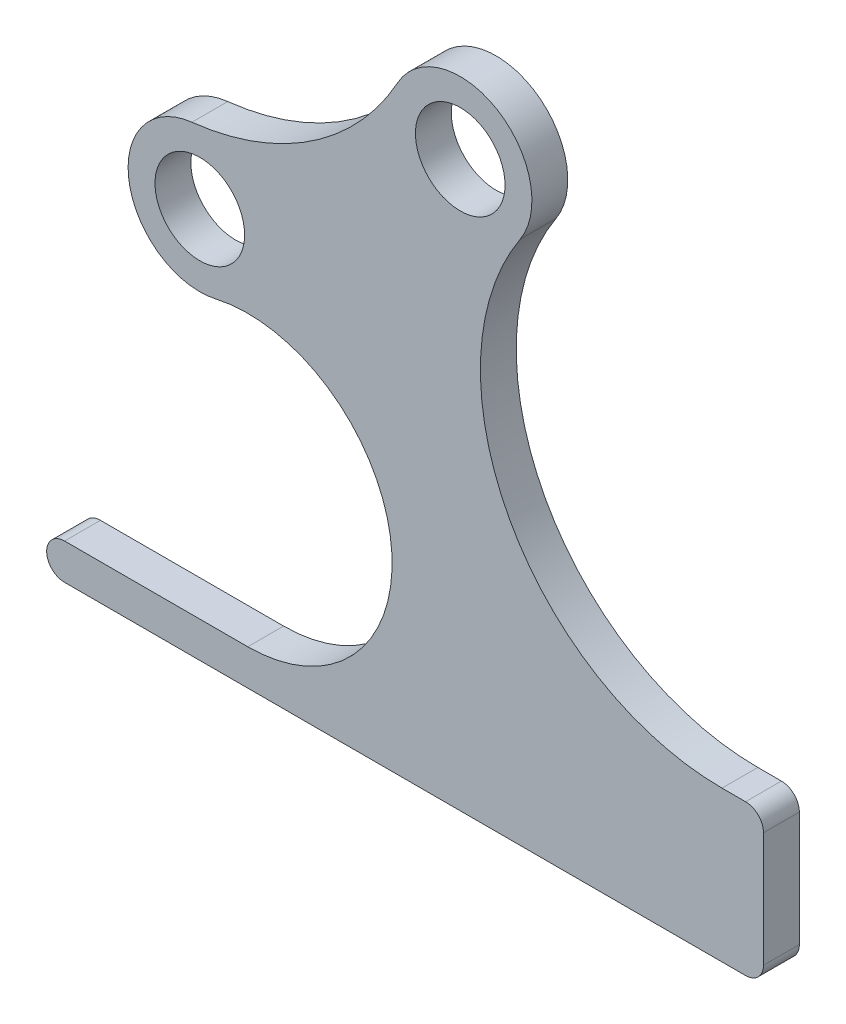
ISO-10303-21;
HEADER;
FILE_DESCRIPTION(('STEP AP214'),'2;1');
FILE_NAME('part.step','',(''),(''),'','','');
FILE_SCHEMA(('AUTOMOTIVE_DESIGN { 1 0 10303 214 1 1 1 1 }'));
ENDSEC;
DATA;
#1=APPLICATION_CONTEXT('core data for automotive mechanical design processes');
#2=APPLICATION_PROTOCOL_DEFINITION('international standard','automotive_design',2000,#1);
#3=PRODUCT_CONTEXT('',#1,'mechanical');
#4=PRODUCT('Part','Part','',(#3));
#5=PRODUCT_RELATED_PRODUCT_CATEGORY('part','',(#4));
#6=PRODUCT_DEFINITION_FORMATION('','',#4);
#7=PRODUCT_DEFINITION_CONTEXT('part definition',#1,'design');
#8=PRODUCT_DEFINITION('design','',#6,#7);
#9=PRODUCT_DEFINITION_SHAPE('','',#8);
#10=(LENGTH_UNIT() NAMED_UNIT(*) SI_UNIT(.MILLI.,.METRE.));
#11=(NAMED_UNIT(*) PLANE_ANGLE_UNIT() SI_UNIT($,.RADIAN.));
#12=(NAMED_UNIT(*) SI_UNIT($,.STERADIAN.) SOLID_ANGLE_UNIT());
#13=UNCERTAINTY_MEASURE_WITH_UNIT(LENGTH_MEASURE(1.E-05),#10,'distance_accuracy_value','');
#14=(GEOMETRIC_REPRESENTATION_CONTEXT(3) GLOBAL_UNCERTAINTY_ASSIGNED_CONTEXT((#13)) GLOBAL_UNIT_ASSIGNED_CONTEXT((#10,
#11,#12)) REPRESENTATION_CONTEXT('',''));
#15=CARTESIAN_POINT('',(0.,0.,0.));
#16=DIRECTION('',(0.,0.,1.));
#17=DIRECTION('',(1.,0.,0.));
#18=AXIS2_PLACEMENT_3D('',#15,#16,#17);
#19=CARTESIAN_POINT('',(-126.091296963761,4.99999999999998,10.));
#20=DIRECTION('',(0.,0.,-1.));
#21=DIRECTION('',(-1.,0.,0.));
#22=AXIS2_PLACEMENT_3D('',#19,#20,#21);
#23=PLANE('',#22);
#24=CARTESIAN_POINT('',(-15.7032811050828,157.437923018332,10.));
#25=DIRECTION('',(0.,0.,1.));
#26=DIRECTION('',(1.,0.,0.));
#27=AXIS2_PLACEMENT_3D('',#24,#25,#26);
#28=CIRCLE('',#27,12.5);
#29=CARTESIAN_POINT('',(-3.20328110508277,157.437923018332,10.));
#30=VERTEX_POINT('',#29);
#31=EDGE_CURVE('E161',#30,#30,#28,.T.);
#32=ORIENTED_EDGE('',*,*,#31,.F.);
#33=EDGE_LOOP('',(#32));
#34=FACE_BOUND('',#33,.T.);
#35=DIRECTION('',(1.,0.,0.));
#36=VECTOR('',#35,1.);
#37=CARTESIAN_POINT('',(63.9087030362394,0.,10.));
#38=LINE('',#37,#36);
#39=CARTESIAN_POINT('',(-126.091296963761,0.,10.));
#40=VERTEX_POINT('',#39);
#41=CARTESIAN_POINT('',(63.9087030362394,0.,10.));
#42=VERTEX_POINT('',#41);
#43=EDGE_CURVE('E50',#40,#42,#38,.T.);
#44=ORIENTED_EDGE('',*,*,#43,.T.);
#45=CARTESIAN_POINT('',(63.9087030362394,5.,10.));
#46=DIRECTION('',(0.,0.,1.));
#47=DIRECTION('',(-1.,0.,0.));
#48=AXIS2_PLACEMENT_3D('',#45,#46,#47);
#49=CIRCLE('',#48,5.);
#50=CARTESIAN_POINT('',(68.9087030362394,5.,10.));
#51=VERTEX_POINT('',#50);
#52=EDGE_CURVE('E106',#42,#51,#49,.T.);
#53=ORIENTED_EDGE('',*,*,#52,.T.);
#54=DIRECTION('',(0.,1.,0.));
#55=VECTOR('',#54,1.);
#56=CARTESIAN_POINT('',(68.9087030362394,37.,10.));
#57=LINE('',#56,#55);
#58=CARTESIAN_POINT('',(68.9087030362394,37.,10.));
#59=VERTEX_POINT('',#58);
#60=EDGE_CURVE('E206',#51,#59,#57,.T.);
#61=ORIENTED_EDGE('',*,*,#60,.T.);
#62=CARTESIAN_POINT('',(63.9087030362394,37.,10.));
#63=DIRECTION('',(0.,0.,1.));
#64=DIRECTION('',(-1.,0.,0.));
#65=AXIS2_PLACEMENT_3D('',#62,#63,#64);
#66=CIRCLE('',#65,5.00000000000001);
#67=CARTESIAN_POINT('',(63.9087030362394,42.,10.));
#68=VERTEX_POINT('',#67);
#69=EDGE_CURVE('E226',#59,#68,#66,.T.);
#70=ORIENTED_EDGE('',*,*,#69,.T.);
#71=DIRECTION('',(-1.,0.,0.));
#72=VECTOR('',#71,1.);
#73=CARTESIAN_POINT('',(57.3337492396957,42.,10.));
#74=LINE('',#73,#72);
#75=CARTESIAN_POINT('',(57.3337492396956,42.,10.));
#76=VERTEX_POINT('',#75);
#77=EDGE_CURVE('E223',#68,#76,#74,.T.);
#78=ORIENTED_EDGE('',*,*,#77,.T.);
#79=CARTESIAN_POINT('',(57.3337492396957,109.412145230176,10.));
#80=DIRECTION('',(0.,0.,-1.));
#81=DIRECTION('',(1.,0.,0.));
#82=AXIS2_PLACEMENT_3D('',#79,#80,#81);
#83=CIRCLE('',#82,67.4121452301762);
#84=CARTESIAN_POINT('',(1.00767597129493,146.449569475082,10.));
#85=VERTEX_POINT('',#84);
#86=EDGE_CURVE('E225',#76,#85,#83,.T.);
#87=ORIENTED_EDGE('',*,*,#86,.T.);
#88=CARTESIAN_POINT('',(-15.7032811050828,157.437923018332,10.));
#89=DIRECTION('',(0.,0.,1.));
#90=DIRECTION('',(-1.,0.,0.));
#91=AXIS2_PLACEMENT_3D('',#88,#89,#90);
#92=CIRCLE('',#91,20.);
#93=CARTESIAN_POINT('',(-33.1959274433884,167.133660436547,10.));
#94=VERTEX_POINT('',#93);
#95=EDGE_CURVE('E228',#85,#94,#92,.T.);
#96=ORIENTED_EDGE('',*,*,#95,.T.);
#97=CARTESIAN_POINT('',(-98.7933512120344,203.492675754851,10.));
#98=DIRECTION('',(0.,0.,-1.));
#99=DIRECTION('',(1.,0.,0.));
#100=AXIS2_PLACEMENT_3D('',#97,#98,#99);
#101=CIRCLE('',#100,75.);
#102=CARTESIAN_POINT('',(-90.5604805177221,128.945912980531,10.));
#103=VERTEX_POINT('',#102);
#104=EDGE_CURVE('E234',#94,#103,#101,.T.);
#105=ORIENTED_EDGE('',*,*,#104,.T.);
#106=CARTESIAN_POINT('',(-88.3650483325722,109.066776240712,10.));
#107=DIRECTION('',(0.,0.,1.));
#108=DIRECTION('',(-1.,0.,0.));
#109=AXIS2_PLACEMENT_3D('',#106,#107,#108);
#110=CIRCLE('',#109,20.);
#111=CARTESIAN_POINT('',(-83.9273688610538,89.5653147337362,10.));
#112=VERTEX_POINT('',#111);
#113=EDGE_CURVE('E138',#103,#112,#110,.T.);
#114=ORIENTED_EDGE('',*,*,#113,.T.);
#115=CARTESIAN_POINT('',(-74.9888296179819,50.28474476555,10.));
#116=DIRECTION('',(0.,0.,-1.));
#117=DIRECTION('',(1.,0.,0.));
#118=AXIS2_PLACEMENT_3D('',#115,#116,#117);
#119=CIRCLE('',#118,40.28474476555);
#120=CARTESIAN_POINT('',(-74.9888296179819,9.99999999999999,10.));
#121=VERTEX_POINT('',#120);
#122=EDGE_CURVE('E132',#112,#121,#119,.T.);
#123=ORIENTED_EDGE('',*,*,#122,.T.);
#124=DIRECTION('',(-1.,0.,0.));
#125=VECTOR('',#124,1.);
#126=CARTESIAN_POINT('',(-126.091296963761,9.99999999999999,10.));
#127=LINE('',#126,#125);
#128=CARTESIAN_POINT('',(-126.091296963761,9.99999999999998,10.));
#129=VERTEX_POINT('',#128);
#130=EDGE_CURVE('E136',#121,#129,#127,.T.);
#131=ORIENTED_EDGE('',*,*,#130,.T.);
#132=CARTESIAN_POINT('',(-126.091296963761,4.99999999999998,10.));
#133=DIRECTION('',(0.,0.,1.));
#134=DIRECTION('',(-1.,0.,0.));
#135=AXIS2_PLACEMENT_3D('',#132,#133,#134);
#136=CIRCLE('',#135,5.);
#137=EDGE_CURVE('E152',#129,#40,#136,.T.);
#138=ORIENTED_EDGE('',*,*,#137,.T.);
#139=EDGE_LOOP('',(#44,#53,#61,#70,#78,#87,#96,#105,#114,#123,#131,#138));
#140=FACE_BOUND('',#139,.T.);
#141=CARTESIAN_POINT('',(-88.3650483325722,109.066776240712,10.));
#142=DIRECTION('',(0.,0.,1.));
#143=DIRECTION('',(1.,0.,0.));
#144=AXIS2_PLACEMENT_3D('',#141,#142,#143);
#145=CIRCLE('',#144,12.5);
#146=CARTESIAN_POINT('',(-75.8650483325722,109.066776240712,10.));
#147=VERTEX_POINT('',#146);
#148=EDGE_CURVE('E253',#147,#147,#145,.T.);
#149=ORIENTED_EDGE('',*,*,#148,.F.);
#150=EDGE_LOOP('',(#149));
#151=FACE_BOUND('',#150,.T.);
#152=ADVANCED_FACE('F33',(#34,#140,#151),#23,.F.);
#153=CARTESIAN_POINT('',(-126.091296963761,4.99999999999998,0.));
#154=DIRECTION('',(0.,0.,-1.));
#155=DIRECTION('',(-1.,0.,0.));
#156=AXIS2_PLACEMENT_3D('',#153,#154,#155);
#157=PLANE('',#156);
#158=CARTESIAN_POINT('',(-15.7032811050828,157.437923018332,0.));
#159=DIRECTION('',(0.,0.,1.));
#160=DIRECTION('',(1.,0.,0.));
#161=AXIS2_PLACEMENT_3D('',#158,#159,#160);
#162=CIRCLE('',#161,12.5);
#163=CARTESIAN_POINT('',(-3.20328110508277,157.437923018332,0.));
#164=VERTEX_POINT('',#163);
#165=EDGE_CURVE('E250',#164,#164,#162,.T.);
#166=ORIENTED_EDGE('',*,*,#165,.T.);
#167=EDGE_LOOP('',(#166));
#168=FACE_BOUND('',#167,.T.);
#169=CARTESIAN_POINT('',(63.9087030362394,5.,0.));
#170=DIRECTION('',(0.,0.,1.));
#171=DIRECTION('',(-1.,0.,0.));
#172=AXIS2_PLACEMENT_3D('',#169,#170,#171);
#173=CIRCLE('',#172,5.);
#174=CARTESIAN_POINT('',(63.9087030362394,0.,0.));
#175=VERTEX_POINT('',#174);
#176=CARTESIAN_POINT('',(68.9087030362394,5.,0.));
#177=VERTEX_POINT('',#176);
#178=EDGE_CURVE('E158',#175,#177,#173,.T.);
#179=ORIENTED_EDGE('',*,*,#178,.F.);
#180=DIRECTION('',(1.,0.,0.));
#181=VECTOR('',#180,1.);
#182=CARTESIAN_POINT('',(0.,0.,0.));
#183=LINE('',#182,#181);
#184=CARTESIAN_POINT('',(-126.091296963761,0.,0.));
#185=VERTEX_POINT('',#184);
#186=EDGE_CURVE('E178',#185,#175,#183,.T.);
#187=ORIENTED_EDGE('',*,*,#186,.F.);
#188=CARTESIAN_POINT('',(-126.091296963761,4.99999999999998,0.));
#189=DIRECTION('',(0.,0.,1.));
#190=DIRECTION('',(-1.,0.,0.));
#191=AXIS2_PLACEMENT_3D('',#188,#189,#190);
#192=CIRCLE('',#191,5.);
#193=CARTESIAN_POINT('',(-126.091296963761,9.99999999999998,0.));
#194=VERTEX_POINT('',#193);
#195=EDGE_CURVE('E99',#194,#185,#192,.T.);
#196=ORIENTED_EDGE('',*,*,#195,.F.);
#197=DIRECTION('',(-1.,0.,0.));
#198=VECTOR('',#197,1.);
#199=CARTESIAN_POINT('',(-126.091296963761,9.99999999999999,0.));
#200=LINE('',#199,#198);
#201=CARTESIAN_POINT('',(-74.9888296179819,9.99999999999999,0.));
#202=VERTEX_POINT('',#201);
#203=EDGE_CURVE('E92',#202,#194,#200,.T.);
#204=ORIENTED_EDGE('',*,*,#203,.F.);
#205=CARTESIAN_POINT('',(-74.9888296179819,50.28474476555,0.));
#206=DIRECTION('',(0.,0.,-1.));
#207=DIRECTION('',(1.,0.,0.));
#208=AXIS2_PLACEMENT_3D('',#205,#206,#207);
#209=CIRCLE('',#208,40.28474476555);
#210=CARTESIAN_POINT('',(-83.9273688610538,89.5653147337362,0.));
#211=VERTEX_POINT('',#210);
#212=EDGE_CURVE('E146',#211,#202,#209,.T.);
#213=ORIENTED_EDGE('',*,*,#212,.F.);
#214=CARTESIAN_POINT('',(-88.3650483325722,109.066776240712,0.));
#215=DIRECTION('',(0.,0.,1.));
#216=DIRECTION('',(-1.,0.,0.));
#217=AXIS2_PLACEMENT_3D('',#214,#215,#216);
#218=CIRCLE('',#217,20.);
#219=CARTESIAN_POINT('',(-90.5604805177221,128.945912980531,0.));
#220=VERTEX_POINT('',#219);
#221=EDGE_CURVE('E173',#220,#211,#218,.T.);
#222=ORIENTED_EDGE('',*,*,#221,.F.);
#223=CARTESIAN_POINT('',(-98.7933512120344,203.492675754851,0.));
#224=DIRECTION('',(0.,0.,-1.));
#225=DIRECTION('',(1.,0.,0.));
#226=AXIS2_PLACEMENT_3D('',#223,#224,#225);
#227=CIRCLE('',#226,75.);
#228=CARTESIAN_POINT('',(-33.1959274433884,167.133660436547,0.));
#229=VERTEX_POINT('',#228);
#230=EDGE_CURVE('E171',#229,#220,#227,.T.);
#231=ORIENTED_EDGE('',*,*,#230,.F.);
#232=CARTESIAN_POINT('',(-15.7032811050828,157.437923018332,0.));
#233=DIRECTION('',(0.,0.,1.));
#234=DIRECTION('',(-1.,0.,0.));
#235=AXIS2_PLACEMENT_3D('',#232,#233,#234);
#236=CIRCLE('',#235,20.);
#237=CARTESIAN_POINT('',(1.00767597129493,146.449569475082,0.));
#238=VERTEX_POINT('',#237);
#239=EDGE_CURVE('E169',#238,#229,#236,.T.);
#240=ORIENTED_EDGE('',*,*,#239,.F.);
#241=CARTESIAN_POINT('',(57.3337492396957,109.412145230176,0.));
#242=DIRECTION('',(0.,0.,-1.));
#243=DIRECTION('',(1.,0.,0.));
#244=AXIS2_PLACEMENT_3D('',#241,#242,#243);
#245=CIRCLE('',#244,67.4121452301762);
#246=CARTESIAN_POINT('',(57.3337492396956,42.,0.));
#247=VERTEX_POINT('',#246);
#248=EDGE_CURVE('E167',#247,#238,#245,.T.);
#249=ORIENTED_EDGE('',*,*,#248,.F.);
#250=DIRECTION('',(-1.,0.,0.));
#251=VECTOR('',#250,1.);
#252=CARTESIAN_POINT('',(57.3337492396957,42.,0.));
#253=LINE('',#252,#251);
#254=CARTESIAN_POINT('',(63.9087030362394,42.,0.));
#255=VERTEX_POINT('',#254);
#256=EDGE_CURVE('E165',#255,#247,#253,.T.);
#257=ORIENTED_EDGE('',*,*,#256,.F.);
#258=CARTESIAN_POINT('',(63.9087030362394,37.,0.));
#259=DIRECTION('',(0.,0.,1.));
#260=DIRECTION('',(-1.,0.,0.));
#261=AXIS2_PLACEMENT_3D('',#258,#259,#260);
#262=CIRCLE('',#261,5.00000000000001);
#263=CARTESIAN_POINT('',(68.9087030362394,37.,0.));
#264=VERTEX_POINT('',#263);
#265=EDGE_CURVE('E163',#264,#255,#262,.T.);
#266=ORIENTED_EDGE('',*,*,#265,.F.);
#267=DIRECTION('',(0.,1.,0.));
#268=VECTOR('',#267,1.);
#269=CARTESIAN_POINT('',(68.9087030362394,37.,0.));
#270=LINE('',#269,#268);
#271=EDGE_CURVE('E160',#177,#264,#270,.T.);
#272=ORIENTED_EDGE('',*,*,#271,.F.);
#273=EDGE_LOOP('',(#179,#187,#196,#204,#213,#222,#231,#240,#249,#257,#266,#272));
#274=FACE_BOUND('',#273,.T.);
#275=CARTESIAN_POINT('',(-88.3650483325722,109.066776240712,0.));
#276=DIRECTION('',(0.,0.,1.));
#277=DIRECTION('',(1.,0.,0.));
#278=AXIS2_PLACEMENT_3D('',#275,#276,#277);
#279=CIRCLE('',#278,12.5);
#280=CARTESIAN_POINT('',(-75.8650483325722,109.066776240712,0.));
#281=VERTEX_POINT('',#280);
#282=EDGE_CURVE('E256',#281,#281,#279,.T.);
#283=ORIENTED_EDGE('',*,*,#282,.T.);
#284=EDGE_LOOP('',(#283));
#285=FACE_BOUND('',#284,.T.);
#286=ADVANCED_FACE('F210',(#168,#274,#285),#157,.T.);
#287=CARTESIAN_POINT('',(63.9087030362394,5.,10.));
#288=DIRECTION('',(0.,0.,-1.));
#289=DIRECTION('',(-1.,0.,0.));
#290=AXIS2_PLACEMENT_3D('',#287,#288,#289);
#291=CYLINDRICAL_SURFACE('',#290,5.);
#292=ORIENTED_EDGE('',*,*,#178,.T.);
#293=DIRECTION('',(0.,0.,-1.));
#294=VECTOR('',#293,1.);
#295=CARTESIAN_POINT('',(68.9087030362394,5.,10.));
#296=LINE('',#295,#294);
#297=EDGE_CURVE('E42',#51,#177,#296,.T.);
#298=ORIENTED_EDGE('',*,*,#297,.F.);
#299=ORIENTED_EDGE('',*,*,#52,.F.);
#300=DIRECTION('',(0.,0.,-1.));
#301=VECTOR('',#300,1.);
#302=CARTESIAN_POINT('',(63.9087030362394,0.,10.));
#303=LINE('',#302,#301);
#304=EDGE_CURVE('E11',#42,#175,#303,.T.);
#305=ORIENTED_EDGE('',*,*,#304,.T.);
#306=EDGE_LOOP('',(#292,#298,#299,#305));
#307=FACE_BOUND('',#306,.T.);
#308=ADVANCED_FACE('F35',(#307),#291,.T.);
#309=CARTESIAN_POINT('',(68.9087030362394,37.,10.));
#310=DIRECTION('',(-1.,0.,0.));
#311=DIRECTION('',(0.,-1.,0.));
#312=AXIS2_PLACEMENT_3D('',#309,#310,#311);
#313=PLANE('',#312);
#314=ORIENTED_EDGE('',*,*,#271,.T.);
#315=DIRECTION('',(0.,0.,-1.));
#316=VECTOR('',#315,1.);
#317=CARTESIAN_POINT('',(68.9087030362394,37.,10.));
#318=LINE('',#317,#316);
#319=EDGE_CURVE('E198',#59,#264,#318,.T.);
#320=ORIENTED_EDGE('',*,*,#319,.F.);
#321=ORIENTED_EDGE('',*,*,#60,.F.);
#322=ORIENTED_EDGE('',*,*,#297,.T.);
#323=EDGE_LOOP('',(#314,#320,#321,#322));
#324=FACE_BOUND('',#323,.T.);
#325=ADVANCED_FACE('F204',(#324),#313,.F.);
#326=CARTESIAN_POINT('',(63.9087030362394,37.,10.));
#327=DIRECTION('',(0.,0.,-1.));
#328=DIRECTION('',(-1.,0.,0.));
#329=AXIS2_PLACEMENT_3D('',#326,#327,#328);
#330=CYLINDRICAL_SURFACE('',#329,5.00000000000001);
#331=ORIENTED_EDGE('',*,*,#265,.T.);
#332=DIRECTION('',(0.,0.,-1.));
#333=VECTOR('',#332,1.);
#334=CARTESIAN_POINT('',(63.9087030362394,42.,10.));
#335=LINE('',#334,#333);
#336=EDGE_CURVE('E195',#68,#255,#335,.T.);
#337=ORIENTED_EDGE('',*,*,#336,.F.);
#338=ORIENTED_EDGE('',*,*,#69,.F.);
#339=ORIENTED_EDGE('',*,*,#319,.T.);
#340=EDGE_LOOP('',(#331,#337,#338,#339));
#341=FACE_BOUND('',#340,.T.);
#342=ADVANCED_FACE('F217',(#341),#330,.T.);
#343=CARTESIAN_POINT('',(57.3337492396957,42.,10.));
#344=DIRECTION('',(0.,-1.,0.));
#345=DIRECTION('',(0.,0.,-1.));
#346=AXIS2_PLACEMENT_3D('',#343,#344,#345);
#347=PLANE('',#346);
#348=ORIENTED_EDGE('',*,*,#256,.T.);
#349=DIRECTION('',(0.,0.,-1.));
#350=VECTOR('',#349,1.);
#351=CARTESIAN_POINT('',(57.3337492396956,42.,10.));
#352=LINE('',#351,#350);
#353=EDGE_CURVE('E192',#76,#247,#352,.T.);
#354=ORIENTED_EDGE('',*,*,#353,.F.);
#355=ORIENTED_EDGE('',*,*,#77,.F.);
#356=ORIENTED_EDGE('',*,*,#336,.T.);
#357=EDGE_LOOP('',(#348,#354,#355,#356));
#358=FACE_BOUND('',#357,.T.);
#359=ADVANCED_FACE('F221',(#358),#347,.F.);
#360=CARTESIAN_POINT('',(57.3337492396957,109.412145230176,10.));
#361=DIRECTION('',(0.,0.,-1.));
#362=DIRECTION('',(-1.,0.,0.));
#363=AXIS2_PLACEMENT_3D('',#360,#361,#362);
#364=CYLINDRICAL_SURFACE('',#363,67.4121452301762);
#365=ORIENTED_EDGE('',*,*,#248,.T.);
#366=DIRECTION('',(0.,0.,-1.));
#367=VECTOR('',#366,1.);
#368=CARTESIAN_POINT('',(1.00767597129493,146.449569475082,10.));
#369=LINE('',#368,#367);
#370=EDGE_CURVE('E189',#85,#238,#369,.T.);
#371=ORIENTED_EDGE('',*,*,#370,.F.);
#372=ORIENTED_EDGE('',*,*,#86,.F.);
#373=ORIENTED_EDGE('',*,*,#353,.T.);
#374=EDGE_LOOP('',(#365,#371,#372,#373));
#375=FACE_BOUND('',#374,.T.);
#376=ADVANCED_FACE('F292',(#375),#364,.F.);
#377=CARTESIAN_POINT('',(-15.7032811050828,157.437923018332,10.));
#378=DIRECTION('',(0.,0.,-1.));
#379=DIRECTION('',(-1.,0.,0.));
#380=AXIS2_PLACEMENT_3D('',#377,#378,#379);
#381=CYLINDRICAL_SURFACE('',#380,20.);
#382=ORIENTED_EDGE('',*,*,#239,.T.);
#383=DIRECTION('',(0.,0.,-1.));
#384=VECTOR('',#383,1.);
#385=CARTESIAN_POINT('',(-33.1959274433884,167.133660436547,10.));
#386=LINE('',#385,#384);
#387=EDGE_CURVE('E186',#94,#229,#386,.T.);
#388=ORIENTED_EDGE('',*,*,#387,.F.);
#389=ORIENTED_EDGE('',*,*,#95,.F.);
#390=ORIENTED_EDGE('',*,*,#370,.T.);
#391=EDGE_LOOP('',(#382,#388,#389,#390));
#392=FACE_BOUND('',#391,.T.);
#393=ADVANCED_FACE('F289',(#392),#381,.T.);
#394=CARTESIAN_POINT('',(-98.7933512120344,203.492675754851,10.));
#395=DIRECTION('',(0.,0.,-1.));
#396=DIRECTION('',(-1.,0.,0.));
#397=AXIS2_PLACEMENT_3D('',#394,#395,#396);
#398=CYLINDRICAL_SURFACE('',#397,75.);
#399=ORIENTED_EDGE('',*,*,#230,.T.);
#400=DIRECTION('',(0.,0.,-1.));
#401=VECTOR('',#400,1.);
#402=CARTESIAN_POINT('',(-90.5604805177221,128.945912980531,10.));
#403=LINE('',#402,#401);
#404=EDGE_CURVE('E183',#103,#220,#403,.T.);
#405=ORIENTED_EDGE('',*,*,#404,.F.);
#406=ORIENTED_EDGE('',*,*,#104,.F.);
#407=ORIENTED_EDGE('',*,*,#387,.T.);
#408=EDGE_LOOP('',(#399,#405,#406,#407));
#409=FACE_BOUND('',#408,.T.);
#410=ADVANCED_FACE('F240',(#409),#398,.F.);
#411=CARTESIAN_POINT('',(-88.3650483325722,109.066776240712,10.));
#412=DIRECTION('',(0.,0.,-1.));
#413=DIRECTION('',(-1.,0.,0.));
#414=AXIS2_PLACEMENT_3D('',#411,#412,#413);
#415=CYLINDRICAL_SURFACE('',#414,20.);
#416=ORIENTED_EDGE('',*,*,#221,.T.);
#417=DIRECTION('',(0.,0.,-1.));
#418=VECTOR('',#417,1.);
#419=CARTESIAN_POINT('',(-83.9273688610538,89.5653147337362,10.));
#420=LINE('',#419,#418);
#421=EDGE_CURVE('E147',#112,#211,#420,.T.);
#422=ORIENTED_EDGE('',*,*,#421,.F.);
#423=ORIENTED_EDGE('',*,*,#113,.F.);
#424=ORIENTED_EDGE('',*,*,#404,.T.);
#425=EDGE_LOOP('',(#416,#422,#423,#424));
#426=FACE_BOUND('',#425,.T.);
#427=ADVANCED_FACE('F244',(#426),#415,.T.);
#428=CARTESIAN_POINT('',(-74.9888296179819,50.28474476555,10.));
#429=DIRECTION('',(0.,0.,-1.));
#430=DIRECTION('',(-1.,0.,0.));
#431=AXIS2_PLACEMENT_3D('',#428,#429,#430);
#432=CYLINDRICAL_SURFACE('',#431,40.28474476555);
#433=ORIENTED_EDGE('',*,*,#212,.T.);
#434=DIRECTION('',(0.,0.,-1.));
#435=VECTOR('',#434,1.);
#436=CARTESIAN_POINT('',(-74.9888296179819,9.99999999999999,10.));
#437=LINE('',#436,#435);
#438=EDGE_CURVE('E143',#121,#202,#437,.T.);
#439=ORIENTED_EDGE('',*,*,#438,.F.);
#440=ORIENTED_EDGE('',*,*,#122,.F.);
#441=ORIENTED_EDGE('',*,*,#421,.T.);
#442=EDGE_LOOP('',(#433,#439,#440,#441));
#443=FACE_BOUND('',#442,.T.);
#444=ADVANCED_FACE('F144',(#443),#432,.F.);
#445=CARTESIAN_POINT('',(-126.091296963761,9.99999999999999,10.));
#446=DIRECTION('',(0.,-1.,0.));
#447=DIRECTION('',(1.,0.,0.));
#448=AXIS2_PLACEMENT_3D('',#445,#446,#447);
#449=PLANE('',#448);
#450=ORIENTED_EDGE('',*,*,#203,.T.);
#451=DIRECTION('',(0.,0.,-1.));
#452=VECTOR('',#451,1.);
#453=CARTESIAN_POINT('',(-126.091296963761,9.99999999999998,10.));
#454=LINE('',#453,#452);
#455=EDGE_CURVE('E148',#129,#194,#454,.T.);
#456=ORIENTED_EDGE('',*,*,#455,.F.);
#457=ORIENTED_EDGE('',*,*,#130,.F.);
#458=ORIENTED_EDGE('',*,*,#438,.T.);
#459=EDGE_LOOP('',(#450,#456,#457,#458));
#460=FACE_BOUND('',#459,.T.);
#461=ADVANCED_FACE('F150',(#460),#449,.F.);
#462=CARTESIAN_POINT('',(-126.091296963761,4.99999999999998,10.));
#463=DIRECTION('',(0.,0.,-1.));
#464=DIRECTION('',(-1.,0.,0.));
#465=AXIS2_PLACEMENT_3D('',#462,#463,#464);
#466=CYLINDRICAL_SURFACE('',#465,5.);
#467=ORIENTED_EDGE('',*,*,#195,.T.);
#468=DIRECTION('',(0.,0.,-1.));
#469=VECTOR('',#468,1.);
#470=CARTESIAN_POINT('',(-126.091296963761,0.,10.));
#471=LINE('',#470,#469);
#472=EDGE_CURVE('E154',#40,#185,#471,.T.);
#473=ORIENTED_EDGE('',*,*,#472,.F.);
#474=ORIENTED_EDGE('',*,*,#137,.F.);
#475=ORIENTED_EDGE('',*,*,#455,.T.);
#476=EDGE_LOOP('',(#467,#473,#474,#475));
#477=FACE_BOUND('',#476,.T.);
#478=ADVANCED_FACE('F246',(#477),#466,.T.);
#479=CARTESIAN_POINT('',(0.,0.,10.));
#480=DIRECTION('',(0.,1.,0.));
#481=DIRECTION('',(-1.,0.,0.));
#482=AXIS2_PLACEMENT_3D('',#479,#480,#481);
#483=PLANE('',#482);
#484=ORIENTED_EDGE('',*,*,#186,.T.);
#485=ORIENTED_EDGE('',*,*,#304,.F.);
#486=ORIENTED_EDGE('',*,*,#43,.F.);
#487=ORIENTED_EDGE('',*,*,#472,.T.);
#488=EDGE_LOOP('',(#484,#485,#486,#487));
#489=FACE_BOUND('',#488,.T.);
#490=ADVANCED_FACE('F245',(#489),#483,.F.);
#491=CARTESIAN_POINT('',(-15.7032811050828,157.437923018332,10.));
#492=DIRECTION('',(0.,0.,-1.));
#493=DIRECTION('',(-1.,0.,0.));
#494=AXIS2_PLACEMENT_3D('',#491,#492,#493);
#495=CYLINDRICAL_SURFACE('',#494,12.5);
#496=ORIENTED_EDGE('',*,*,#31,.T.);
#497=EDGE_LOOP('',(#496));
#498=FACE_BOUND('',#497,.T.);
#499=ORIENTED_EDGE('',*,*,#165,.F.);
#500=EDGE_LOOP('',(#499));
#501=FACE_BOUND('',#500,.T.);
#502=ADVANCED_FACE('F274',(#498,#501),#495,.F.);
#503=CARTESIAN_POINT('',(-88.3650483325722,109.066776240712,10.));
#504=DIRECTION('',(0.,0.,-1.));
#505=DIRECTION('',(-1.,0.,0.));
#506=AXIS2_PLACEMENT_3D('',#503,#504,#505);
#507=CYLINDRICAL_SURFACE('',#506,12.5);
#508=ORIENTED_EDGE('',*,*,#148,.T.);
#509=EDGE_LOOP('',(#508));
#510=FACE_BOUND('',#509,.T.);
#511=ORIENTED_EDGE('',*,*,#282,.F.);
#512=EDGE_LOOP('',(#511));
#513=FACE_BOUND('',#512,.T.);
#514=ADVANCED_FACE('F262',(#510,#513),#507,.F.);
#515=CLOSED_SHELL('',(#152,#286,#308,#325,#342,#359,#376,#393,#410,#427,#444,#461,#478,#490,
#502,#514));
#516=MANIFOLD_SOLID_BREP('B2',#515);
#517=ADVANCED_BREP_SHAPE_REPRESENTATION('',(#18,#516),#14);
#518=SHAPE_DEFINITION_REPRESENTATION(#9,#517);
ENDSEC;
END-ISO-10303-21;
